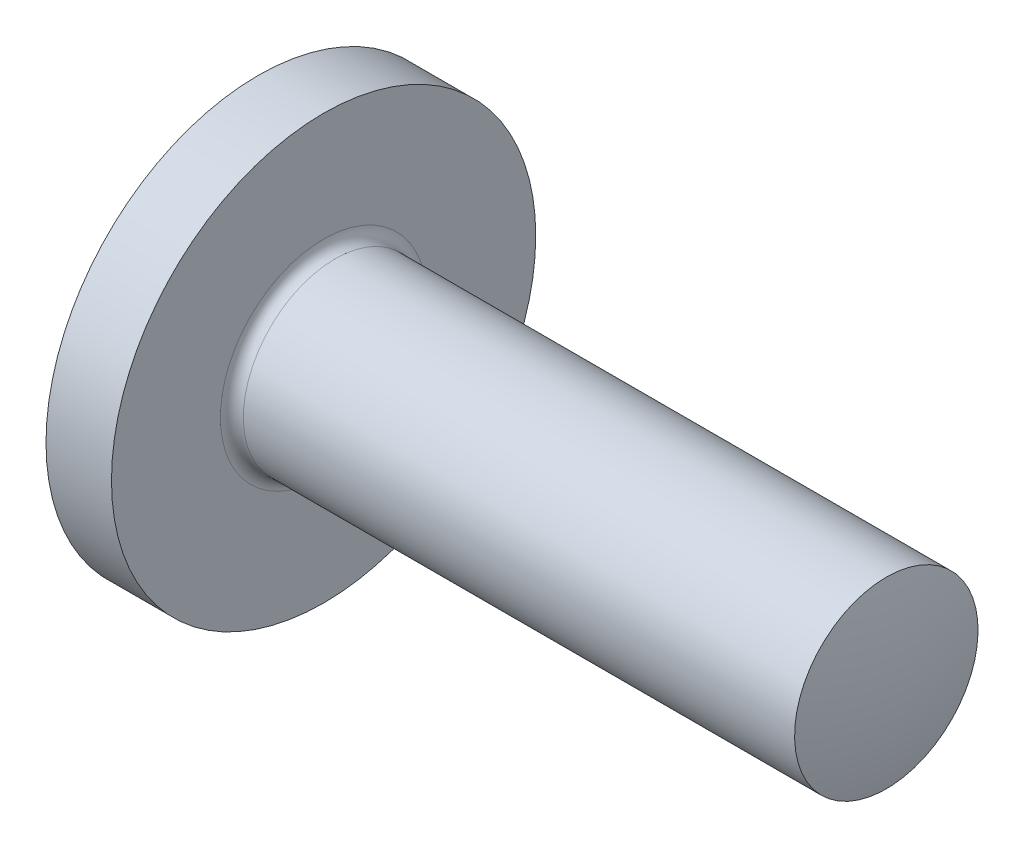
ISO-10303-21;
HEADER;
FILE_DESCRIPTION(('STEP AP214'),'2;1');
FILE_NAME('part.step','',(''),(''),'','','');
FILE_SCHEMA(('AUTOMOTIVE_DESIGN { 1 0 10303 214 1 1 1 1 }'));
ENDSEC;
DATA;
#1=APPLICATION_CONTEXT('core data for automotive mechanical design processes');
#2=APPLICATION_PROTOCOL_DEFINITION('international standard','automotive_design',2000,#1);
#3=PRODUCT_CONTEXT('',#1,'mechanical');
#4=PRODUCT('Part','Part','',(#3));
#5=PRODUCT_RELATED_PRODUCT_CATEGORY('part','',(#4));
#6=PRODUCT_DEFINITION_FORMATION('','',#4);
#7=PRODUCT_DEFINITION_CONTEXT('part definition',#1,'design');
#8=PRODUCT_DEFINITION('design','',#6,#7);
#9=PRODUCT_DEFINITION_SHAPE('','',#8);
#10=(LENGTH_UNIT() NAMED_UNIT(*) SI_UNIT(.MILLI.,.METRE.));
#11=(NAMED_UNIT(*) PLANE_ANGLE_UNIT() SI_UNIT($,.RADIAN.));
#12=(NAMED_UNIT(*) SI_UNIT($,.STERADIAN.) SOLID_ANGLE_UNIT());
#13=UNCERTAINTY_MEASURE_WITH_UNIT(LENGTH_MEASURE(1.E-05),#10,'distance_accuracy_value','');
#14=(GEOMETRIC_REPRESENTATION_CONTEXT(3) GLOBAL_UNCERTAINTY_ASSIGNED_CONTEXT((#13)) GLOBAL_UNIT_ASSIGNED_CONTEXT((#10,
#11,#12)) REPRESENTATION_CONTEXT('',''));
#15=CARTESIAN_POINT('',(0.,0.,0.));
#16=DIRECTION('',(0.,0.,1.));
#17=DIRECTION('',(1.,0.,0.));
#18=AXIS2_PLACEMENT_3D('',#15,#16,#17);
#19=CARTESIAN_POINT('',(1.1,0.,0.));
#20=DIRECTION('',(1.,0.,0.));
#21=DIRECTION('',(0.,0.,-1.));
#22=AXIS2_PLACEMENT_3D('',#19,#20,#21);
#23=PLANE('',#22);
#24=CARTESIAN_POINT('',(1.1,0.,0.));
#25=DIRECTION('',(1.,0.,0.));
#26=DIRECTION('',(0.,0.,-1.));
#27=AXIS2_PLACEMENT_3D('',#24,#25,#26);
#28=CIRCLE('',#27,0.9);
#29=CARTESIAN_POINT('',(1.1,0.,-0.9));
#30=VERTEX_POINT('',#29);
#31=EDGE_CURVE('E11',#30,#30,#28,.F.);
#32=ORIENTED_EDGE('',*,*,#31,.T.);
#33=EDGE_LOOP('',(#32));
#34=FACE_BOUND('',#33,.T.);
#35=CARTESIAN_POINT('',(1.1,0.,0.));
#36=DIRECTION('',(1.,0.,0.));
#37=DIRECTION('',(0.,0.,-1.));
#38=AXIS2_PLACEMENT_3D('',#35,#36,#37);
#39=CIRCLE('',#38,1.85);
#40=CARTESIAN_POINT('',(1.1,0.,-1.85));
#41=VERTEX_POINT('',#40);
#42=EDGE_CURVE('E77',#41,#41,#39,.T.);
#43=ORIENTED_EDGE('',*,*,#42,.T.);
#44=EDGE_LOOP('',(#43));
#45=FACE_BOUND('',#44,.T.);
#46=ADVANCED_FACE('F43',(#34,#45),#23,.T.);
#47=CARTESIAN_POINT('',(1.1,0.,0.));
#48=DIRECTION('',(-1.,0.,0.));
#49=DIRECTION('',(0.,0.,1.));
#50=AXIS2_PLACEMENT_3D('',#47,#48,#49);
#51=CYLINDRICAL_SURFACE('',#50,1.85);
#52=CARTESIAN_POINT('',(0.528889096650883,0.,0.));
#53=DIRECTION('',(1.,0.,0.));
#54=DIRECTION('',(0.,1.,0.));
#55=AXIS2_PLACEMENT_3D('',#52,#53,#54);
#56=CIRCLE('',#55,1.85);
#57=CARTESIAN_POINT('',(0.528889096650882,1.85,0.));
#58=VERTEX_POINT('',#57);
#59=EDGE_CURVE('E137',#58,#58,#56,.T.);
#60=ORIENTED_EDGE('',*,*,#59,.T.);
#61=EDGE_LOOP('',(#60));
#62=FACE_BOUND('',#61,.T.);
#63=ORIENTED_EDGE('',*,*,#42,.F.);
#64=EDGE_LOOP('',(#63));
#65=FACE_BOUND('',#64,.T.);
#66=ADVANCED_FACE('F112',(#62,#65),#51,.T.);
#67=CARTESIAN_POINT('',(6.10000000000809,0.,0.));
#68=DIRECTION('',(-1.,0.,0.));
#69=DIRECTION('',(0.,0.,1.));
#70=AXIS2_PLACEMENT_3D('',#67,#68,#69);
#71=CYLINDRICAL_SURFACE('',#70,0.8);
#72=CARTESIAN_POINT('',(1.2,0.,0.));
#73=DIRECTION('',(1.,0.,0.));
#74=DIRECTION('',(0.,0.,-1.));
#75=AXIS2_PLACEMENT_3D('',#72,#73,#74);
#76=CIRCLE('',#75,0.8);
#77=CARTESIAN_POINT('',(1.2,0.,-0.8));
#78=VERTEX_POINT('',#77);
#79=EDGE_CURVE('E51',#78,#78,#76,.T.);
#80=ORIENTED_EDGE('',*,*,#79,.T.);
#81=EDGE_LOOP('',(#80));
#82=FACE_BOUND('',#81,.T.);
#83=CARTESIAN_POINT('',(6.00734500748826,0.,0.));
#84=DIRECTION('',(1.,0.,0.));
#85=DIRECTION('',(0.,1.,0.));
#86=AXIS2_PLACEMENT_3D('',#83,#84,#85);
#87=CIRCLE('',#86,0.799999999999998);
#88=CARTESIAN_POINT('',(6.00734500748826,0.800000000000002,0.));
#89=VERTEX_POINT('',#88);
#90=EDGE_CURVE('E88',#89,#89,#87,.T.);
#91=ORIENTED_EDGE('',*,*,#90,.F.);
#92=EDGE_LOOP('',(#91));
#93=FACE_BOUND('',#92,.T.);
#94=ADVANCED_FACE('F99',(#82,#93),#71,.T.);
#95=CARTESIAN_POINT('',(2.6000000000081,0.,0.));
#96=DIRECTION('',(1.,0.,0.));
#97=DIRECTION('',(0.,1.,0.));
#98=AXIS2_PLACEMENT_3D('',#95,#96,#97);
#99=SPHERICAL_SURFACE('',#98,3.5);
#100=CARTESIAN_POINT('',(6.1000000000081,0.,0.));
#101=VERTEX_POINT('',#100);
#102=VERTEX_LOOP('',#101);
#103=FACE_BOUND('',#102,.T.);
#104=ORIENTED_EDGE('',*,*,#90,.T.);
#105=EDGE_LOOP('',(#104));
#106=FACE_BOUND('',#105,.T.);
#107=ADVANCED_FACE('F123',(#103,#106),#99,.T.);
#108=CARTESIAN_POINT('',(3.5,0.,0.));
#109=DIRECTION('',(1.,0.,0.));
#110=DIRECTION('',(0.,1.,0.));
#111=AXIS2_PLACEMENT_3D('',#108,#109,#110);
#112=SPHERICAL_SURFACE('',#111,3.5);
#113=ORIENTED_EDGE('',*,*,#59,.F.);
#114=EDGE_LOOP('',(#113));
#115=FACE_BOUND('',#114,.T.);
#116=CARTESIAN_POINT('',(0.5,0.,0.));
#117=DIRECTION('',(1.,0.,0.));
#118=DIRECTION('',(0.,1.,0.));
#119=AXIS2_PLACEMENT_3D('',#116,#117,#118);
#120=CIRCLE('',#119,1.802775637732);
#121=CARTESIAN_POINT('',(0.5,-0.25,1.78535710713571));
#122=VERTEX_POINT('',#121);
#123=CARTESIAN_POINT('',(0.5,0.25,1.78535710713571));
#124=VERTEX_POINT('',#123);
#125=EDGE_CURVE('E58',#122,#124,#120,.F.);
#126=ORIENTED_EDGE('',*,*,#125,.F.);
#127=CARTESIAN_POINT('',(3.5,-0.25,0.));
#128=DIRECTION('',(0.,-1.,0.));
#129=DIRECTION('',(0.,0.,-1.));
#130=AXIS2_PLACEMENT_3D('',#127,#128,#129);
#131=CIRCLE('',#130,3.49106001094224);
#132=CARTESIAN_POINT('',(0.5,-0.25,-1.78535710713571));
#133=VERTEX_POINT('',#132);
#134=EDGE_CURVE('E69',#133,#122,#131,.F.);
#135=ORIENTED_EDGE('',*,*,#134,.F.);
#136=CARTESIAN_POINT('',(0.5,0.25,-1.78535710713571));
#137=VERTEX_POINT('',#136);
#138=EDGE_CURVE('E72',#137,#133,#120,.F.);
#139=ORIENTED_EDGE('',*,*,#138,.F.);
#140=CARTESIAN_POINT('',(3.5,0.25,0.));
#141=DIRECTION('',(0.,1.,0.));
#142=DIRECTION('',(0.,0.,1.));
#143=AXIS2_PLACEMENT_3D('',#140,#141,#142);
#144=CIRCLE('',#143,3.49106001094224);
#145=EDGE_CURVE('E85',#124,#137,#144,.F.);
#146=ORIENTED_EDGE('',*,*,#145,.F.);
#147=EDGE_LOOP('',(#126,#135,#139,#146));
#148=FACE_BOUND('',#147,.T.);
#149=ADVANCED_FACE('F71',(#115,#148),#112,.T.);
#150=CARTESIAN_POINT('',(0.,-0.25,-1.85));
#151=DIRECTION('',(0.,-1.,0.));
#152=DIRECTION('',(0.,0.,-1.));
#153=AXIS2_PLACEMENT_3D('',#150,#151,#152);
#154=PLANE('',#153);
#155=DIRECTION('',(0.,0.,1.));
#156=VECTOR('',#155,1.);
#157=CARTESIAN_POINT('',(0.5,-0.25,-1.85));
#158=LINE('',#157,#156);
#159=EDGE_CURVE('E82',#133,#122,#158,.T.);
#160=ORIENTED_EDGE('',*,*,#159,.F.);
#161=ORIENTED_EDGE('',*,*,#134,.T.);
#162=EDGE_LOOP('',(#160,#161));
#163=FACE_BOUND('',#162,.T.);
#164=ADVANCED_FACE('F87',(#163),#154,.F.);
#165=CARTESIAN_POINT('',(0.,0.25,-1.85));
#166=DIRECTION('',(0.,1.,0.));
#167=DIRECTION('',(0.,0.,1.));
#168=AXIS2_PLACEMENT_3D('',#165,#166,#167);
#169=PLANE('',#168);
#170=DIRECTION('',(0.,0.,1.));
#171=VECTOR('',#170,1.);
#172=CARTESIAN_POINT('',(0.5,0.25,-1.85));
#173=LINE('',#172,#171);
#174=EDGE_CURVE('E84',#137,#124,#173,.T.);
#175=ORIENTED_EDGE('',*,*,#174,.T.);
#176=ORIENTED_EDGE('',*,*,#145,.T.);
#177=EDGE_LOOP('',(#175,#176));
#178=FACE_BOUND('',#177,.T.);
#179=ADVANCED_FACE('F108',(#178),#169,.F.);
#180=CARTESIAN_POINT('',(0.5,0.25,-1.85));
#181=DIRECTION('',(1.,0.,0.));
#182=DIRECTION('',(0.,1.,0.));
#183=AXIS2_PLACEMENT_3D('',#180,#181,#182);
#184=PLANE('',#183);
#185=ORIENTED_EDGE('',*,*,#174,.F.);
#186=ORIENTED_EDGE('',*,*,#138,.T.);
#187=ORIENTED_EDGE('',*,*,#159,.T.);
#188=ORIENTED_EDGE('',*,*,#125,.T.);
#189=EDGE_LOOP('',(#185,#186,#187,#188));
#190=FACE_BOUND('',#189,.T.);
#191=ADVANCED_FACE('F81',(#190),#184,.F.);
#192=CARTESIAN_POINT('',(1.2,0.,0.));
#193=DIRECTION('',(1.,0.,0.));
#194=DIRECTION('',(0.,0.,-1.));
#195=AXIS2_PLACEMENT_3D('',#192,#193,#194);
#196=TOROIDAL_SURFACE('',#195,0.9,0.1);
#197=ORIENTED_EDGE('',*,*,#31,.F.);
#198=EDGE_LOOP('',(#197));
#199=FACE_BOUND('',#198,.T.);
#200=ORIENTED_EDGE('',*,*,#79,.F.);
#201=EDGE_LOOP('',(#200));
#202=FACE_BOUND('',#201,.T.);
#203=ADVANCED_FACE('F45',(#199,#202),#196,.F.);
#204=CLOSED_SHELL('',(#46,#66,#94,#107,#149,#164,#179,#191,#203));
#205=MANIFOLD_SOLID_BREP('B2',#204);
#206=ADVANCED_BREP_SHAPE_REPRESENTATION('',(#18,#205),#14);
#207=SHAPE_DEFINITION_REPRESENTATION(#9,#206);
ENDSEC;
END-ISO-10303-21;
